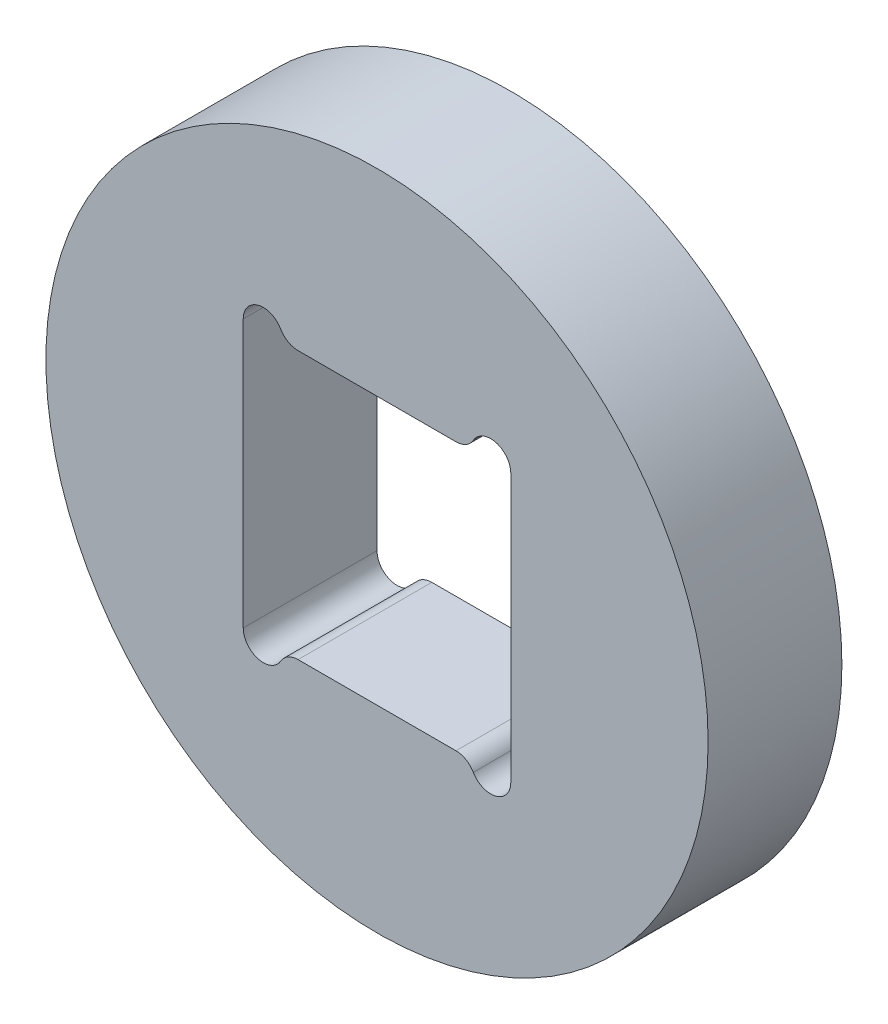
ISO-10303-21;
HEADER;
FILE_DESCRIPTION(('STEP AP214'),'2;1');
FILE_NAME('part.step','',(''),(''),'','','');
FILE_SCHEMA(('AUTOMOTIVE_DESIGN { 1 0 10303 214 1 1 1 1 }'));
ENDSEC;
DATA;
#1=APPLICATION_CONTEXT('core data for automotive mechanical design processes');
#2=APPLICATION_PROTOCOL_DEFINITION('international standard','automotive_design',2000,#1);
#3=PRODUCT_CONTEXT('',#1,'mechanical');
#4=PRODUCT('Part','Part','',(#3));
#5=PRODUCT_RELATED_PRODUCT_CATEGORY('part','',(#4));
#6=PRODUCT_DEFINITION_FORMATION('','',#4);
#7=PRODUCT_DEFINITION_CONTEXT('part definition',#1,'design');
#8=PRODUCT_DEFINITION('design','',#6,#7);
#9=PRODUCT_DEFINITION_SHAPE('','',#8);
#10=(LENGTH_UNIT() NAMED_UNIT(*) SI_UNIT(.MILLI.,.METRE.));
#11=(NAMED_UNIT(*) PLANE_ANGLE_UNIT() SI_UNIT($,.RADIAN.));
#12=(NAMED_UNIT(*) SI_UNIT($,.STERADIAN.) SOLID_ANGLE_UNIT());
#13=UNCERTAINTY_MEASURE_WITH_UNIT(LENGTH_MEASURE(1.E-05),#10,'distance_accuracy_value','');
#14=(GEOMETRIC_REPRESENTATION_CONTEXT(3) GLOBAL_UNCERTAINTY_ASSIGNED_CONTEXT((#13)) GLOBAL_UNIT_ASSIGNED_CONTEXT((#10,
#11,#12)) REPRESENTATION_CONTEXT('',''));
#15=CARTESIAN_POINT('',(0.,0.,0.));
#16=DIRECTION('',(0.,0.,1.));
#17=DIRECTION('',(1.,0.,0.));
#18=AXIS2_PLACEMENT_3D('',#15,#16,#17);
#19=CARTESIAN_POINT('',(0.,0.,10.));
#20=DIRECTION('',(0.,0.,1.));
#21=DIRECTION('',(1.,0.,0.));
#22=AXIS2_PLACEMENT_3D('',#19,#20,#21);
#23=PLANE('',#22);
#24=CARTESIAN_POINT('',(0.,0.,10.));
#25=DIRECTION('',(0.,0.,1.));
#26=DIRECTION('',(1.,0.,0.));
#27=AXIS2_PLACEMENT_3D('',#24,#25,#26);
#28=CIRCLE('',#27,24.75);
#29=CARTESIAN_POINT('',(24.75,0.,10.));
#30=VERTEX_POINT('',#29);
#31=EDGE_CURVE('E11',#30,#30,#28,.T.);
#32=ORIENTED_EDGE('',*,*,#31,.T.);
#33=EDGE_LOOP('',(#32));
#34=FACE_BOUND('',#33,.T.);
#35=DIRECTION('',(0.,-1.,0.));
#36=VECTOR('',#35,1.);
#37=CARTESIAN_POINT('',(-10.,-10.0000000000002,10.));
#38=LINE('',#37,#36);
#39=CARTESIAN_POINT('',(-10.,10.,10.));
#40=VERTEX_POINT('',#39);
#41=CARTESIAN_POINT('',(-10.,-10.0000000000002,10.));
#42=VERTEX_POINT('',#41);
#43=EDGE_CURVE('E144',#40,#42,#38,.T.);
#44=ORIENTED_EDGE('',*,*,#43,.F.);
#45=CARTESIAN_POINT('',(-8.5,10.,10.));
#46=DIRECTION('',(0.,0.,1.));
#47=DIRECTION('',(1.,0.,0.));
#48=AXIS2_PLACEMENT_3D('',#45,#46,#47);
#49=CIRCLE('',#48,1.5);
#50=CARTESIAN_POINT('',(-7.20096189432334,10.75,10.));
#51=VERTEX_POINT('',#50);
#52=EDGE_CURVE('E135',#51,#40,#49,.T.);
#53=ORIENTED_EDGE('',*,*,#52,.F.);
#54=CARTESIAN_POINT('',(-5.90192378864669,11.5,10.));
#55=DIRECTION('',(0.,0.,-1.));
#56=DIRECTION('',(1.,0.,0.));
#57=AXIS2_PLACEMENT_3D('',#54,#55,#56);
#58=CIRCLE('',#57,1.5);
#59=CARTESIAN_POINT('',(-5.90192378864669,10.,10.));
#60=VERTEX_POINT('',#59);
#61=EDGE_CURVE('E187',#60,#51,#58,.T.);
#62=ORIENTED_EDGE('',*,*,#61,.F.);
#63=DIRECTION('',(-1.,0.,0.));
#64=VECTOR('',#63,1.);
#65=CARTESIAN_POINT('',(-5.90192378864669,10.,10.));
#66=LINE('',#65,#64);
#67=CARTESIAN_POINT('',(5.90192378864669,10.,10.));
#68=VERTEX_POINT('',#67);
#69=EDGE_CURVE('E184',#68,#60,#66,.T.);
#70=ORIENTED_EDGE('',*,*,#69,.F.);
#71=CARTESIAN_POINT('',(5.90192378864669,11.5,10.));
#72=DIRECTION('',(0.,0.,-1.));
#73=DIRECTION('',(1.,0.,0.));
#74=AXIS2_PLACEMENT_3D('',#71,#72,#73);
#75=CIRCLE('',#74,1.5);
#76=CARTESIAN_POINT('',(7.20096189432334,10.75,10.));
#77=VERTEX_POINT('',#76);
#78=EDGE_CURVE('E181',#77,#68,#75,.T.);
#79=ORIENTED_EDGE('',*,*,#78,.F.);
#80=CARTESIAN_POINT('',(8.5,10.,10.));
#81=DIRECTION('',(0.,0.,1.));
#82=DIRECTION('',(1.,0.,0.));
#83=AXIS2_PLACEMENT_3D('',#80,#81,#82);
#84=CIRCLE('',#83,1.5);
#85=CARTESIAN_POINT('',(10.,10.,10.));
#86=VERTEX_POINT('',#85);
#87=EDGE_CURVE('E178',#86,#77,#84,.T.);
#88=ORIENTED_EDGE('',*,*,#87,.F.);
#89=DIRECTION('',(0.,1.,0.));
#90=VECTOR('',#89,1.);
#91=CARTESIAN_POINT('',(10.,10.,10.));
#92=LINE('',#91,#90);
#93=CARTESIAN_POINT('',(10.,-10.0000000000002,10.));
#94=VERTEX_POINT('',#93);
#95=EDGE_CURVE('E175',#94,#86,#92,.T.);
#96=ORIENTED_EDGE('',*,*,#95,.F.);
#97=CARTESIAN_POINT('',(8.5,-10.0000000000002,10.));
#98=DIRECTION('',(0.,0.,1.));
#99=DIRECTION('',(1.,0.,0.));
#100=AXIS2_PLACEMENT_3D('',#97,#98,#99);
#101=CIRCLE('',#100,1.5);
#102=CARTESIAN_POINT('',(7.20096189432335,-10.7500000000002,10.));
#103=VERTEX_POINT('',#102);
#104=EDGE_CURVE('E172',#103,#94,#101,.T.);
#105=ORIENTED_EDGE('',*,*,#104,.F.);
#106=CARTESIAN_POINT('',(5.90192378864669,-11.5000000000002,10.));
#107=DIRECTION('',(0.,0.,-1.));
#108=DIRECTION('',(1.,0.,0.));
#109=AXIS2_PLACEMENT_3D('',#106,#107,#108);
#110=CIRCLE('',#109,1.5);
#111=CARTESIAN_POINT('',(5.90192378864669,-10.0000000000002,10.));
#112=VERTEX_POINT('',#111);
#113=EDGE_CURVE('E169',#112,#103,#110,.T.);
#114=ORIENTED_EDGE('',*,*,#113,.F.);
#115=DIRECTION('',(1.,0.,0.));
#116=VECTOR('',#115,1.);
#117=CARTESIAN_POINT('',(5.90192378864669,-10.0000000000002,10.));
#118=LINE('',#117,#116);
#119=CARTESIAN_POINT('',(-5.90192378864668,-10.0000000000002,10.));
#120=VERTEX_POINT('',#119);
#121=EDGE_CURVE('E166',#120,#112,#118,.T.);
#122=ORIENTED_EDGE('',*,*,#121,.F.);
#123=CARTESIAN_POINT('',(-5.90192378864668,-11.5000000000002,10.));
#124=DIRECTION('',(0.,0.,-1.));
#125=DIRECTION('',(1.,0.,0.));
#126=AXIS2_PLACEMENT_3D('',#123,#124,#125);
#127=CIRCLE('',#126,1.5);
#128=CARTESIAN_POINT('',(-7.20096189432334,-10.7500000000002,10.));
#129=VERTEX_POINT('',#128);
#130=EDGE_CURVE('E161',#129,#120,#127,.T.);
#131=ORIENTED_EDGE('',*,*,#130,.F.);
#132=CARTESIAN_POINT('',(-8.5,-10.0000000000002,10.));
#133=DIRECTION('',(0.,0.,1.));
#134=DIRECTION('',(1.,0.,0.));
#135=AXIS2_PLACEMENT_3D('',#132,#133,#134);
#136=CIRCLE('',#135,1.5);
#137=EDGE_CURVE('E157',#42,#129,#136,.T.);
#138=ORIENTED_EDGE('',*,*,#137,.F.);
#139=EDGE_LOOP('',(#44,#53,#62,#70,#79,#88,#96,#105,#114,#122,#131,#138));
#140=FACE_BOUND('',#139,.T.);
#141=ADVANCED_FACE('F45',(#34,#140),#23,.T.);
#142=CARTESIAN_POINT('',(0.,0.,0.));
#143=DIRECTION('',(0.,0.,1.));
#144=DIRECTION('',(1.,0.,0.));
#145=AXIS2_PLACEMENT_3D('',#142,#143,#144);
#146=PLANE('',#145);
#147=CARTESIAN_POINT('',(0.,0.,0.));
#148=DIRECTION('',(0.,0.,1.));
#149=DIRECTION('',(1.,0.,0.));
#150=AXIS2_PLACEMENT_3D('',#147,#148,#149);
#151=CIRCLE('',#150,24.75);
#152=CARTESIAN_POINT('',(24.75,0.,0.));
#153=VERTEX_POINT('',#152);
#154=EDGE_CURVE('E49',#153,#153,#151,.T.);
#155=ORIENTED_EDGE('',*,*,#154,.F.);
#156=EDGE_LOOP('',(#155));
#157=FACE_BOUND('',#156,.T.);
#158=CARTESIAN_POINT('',(-8.5,10.,0.));
#159=DIRECTION('',(0.,0.,1.));
#160=DIRECTION('',(1.,0.,0.));
#161=AXIS2_PLACEMENT_3D('',#158,#159,#160);
#162=CIRCLE('',#161,1.5);
#163=CARTESIAN_POINT('',(-7.20096189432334,10.75,0.));
#164=VERTEX_POINT('',#163);
#165=CARTESIAN_POINT('',(-10.,10.,0.));
#166=VERTEX_POINT('',#165);
#167=EDGE_CURVE('E69',#164,#166,#162,.T.);
#168=ORIENTED_EDGE('',*,*,#167,.T.);
#169=DIRECTION('',(0.,-1.,0.));
#170=VECTOR('',#169,1.);
#171=CARTESIAN_POINT('',(-10.,-10.0000000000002,0.));
#172=LINE('',#171,#170);
#173=CARTESIAN_POINT('',(-10.,-10.0000000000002,0.));
#174=VERTEX_POINT('',#173);
#175=EDGE_CURVE('E151',#166,#174,#172,.T.);
#176=ORIENTED_EDGE('',*,*,#175,.T.);
#177=CARTESIAN_POINT('',(-8.5,-10.0000000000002,0.));
#178=DIRECTION('',(0.,0.,1.));
#179=DIRECTION('',(1.,0.,0.));
#180=AXIS2_PLACEMENT_3D('',#177,#178,#179);
#181=CIRCLE('',#180,1.5);
#182=CARTESIAN_POINT('',(-7.20096189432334,-10.7500000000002,0.));
#183=VERTEX_POINT('',#182);
#184=EDGE_CURVE('E194',#174,#183,#181,.T.);
#185=ORIENTED_EDGE('',*,*,#184,.T.);
#186=CARTESIAN_POINT('',(-5.90192378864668,-11.5000000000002,0.));
#187=DIRECTION('',(0.,0.,-1.));
#188=DIRECTION('',(1.,0.,0.));
#189=AXIS2_PLACEMENT_3D('',#186,#187,#188);
#190=CIRCLE('',#189,1.5);
#191=CARTESIAN_POINT('',(-5.90192378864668,-10.0000000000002,0.));
#192=VERTEX_POINT('',#191);
#193=EDGE_CURVE('E198',#183,#192,#190,.T.);
#194=ORIENTED_EDGE('',*,*,#193,.T.);
#195=DIRECTION('',(1.,0.,0.));
#196=VECTOR('',#195,1.);
#197=CARTESIAN_POINT('',(5.90192378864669,-10.0000000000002,0.));
#198=LINE('',#197,#196);
#199=CARTESIAN_POINT('',(5.90192378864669,-10.0000000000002,0.));
#200=VERTEX_POINT('',#199);
#201=EDGE_CURVE('E202',#192,#200,#198,.T.);
#202=ORIENTED_EDGE('',*,*,#201,.T.);
#203=CARTESIAN_POINT('',(5.90192378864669,-11.5000000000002,0.));
#204=DIRECTION('',(0.,0.,-1.));
#205=DIRECTION('',(1.,0.,0.));
#206=AXIS2_PLACEMENT_3D('',#203,#204,#205);
#207=CIRCLE('',#206,1.5);
#208=CARTESIAN_POINT('',(7.20096189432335,-10.7500000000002,0.));
#209=VERTEX_POINT('',#208);
#210=EDGE_CURVE('E206',#200,#209,#207,.T.);
#211=ORIENTED_EDGE('',*,*,#210,.T.);
#212=CARTESIAN_POINT('',(8.5,-10.0000000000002,0.));
#213=DIRECTION('',(0.,0.,1.));
#214=DIRECTION('',(1.,0.,0.));
#215=AXIS2_PLACEMENT_3D('',#212,#213,#214);
#216=CIRCLE('',#215,1.5);
#217=CARTESIAN_POINT('',(10.,-10.0000000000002,0.));
#218=VERTEX_POINT('',#217);
#219=EDGE_CURVE('E210',#209,#218,#216,.T.);
#220=ORIENTED_EDGE('',*,*,#219,.T.);
#221=DIRECTION('',(0.,1.,0.));
#222=VECTOR('',#221,1.);
#223=CARTESIAN_POINT('',(10.,10.,0.));
#224=LINE('',#223,#222);
#225=CARTESIAN_POINT('',(10.,10.,0.));
#226=VERTEX_POINT('',#225);
#227=EDGE_CURVE('E214',#218,#226,#224,.T.);
#228=ORIENTED_EDGE('',*,*,#227,.T.);
#229=CARTESIAN_POINT('',(8.5,10.,0.));
#230=DIRECTION('',(0.,0.,1.));
#231=DIRECTION('',(1.,0.,0.));
#232=AXIS2_PLACEMENT_3D('',#229,#230,#231);
#233=CIRCLE('',#232,1.5);
#234=CARTESIAN_POINT('',(7.20096189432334,10.75,0.));
#235=VERTEX_POINT('',#234);
#236=EDGE_CURVE('E218',#226,#235,#233,.T.);
#237=ORIENTED_EDGE('',*,*,#236,.T.);
#238=CARTESIAN_POINT('',(5.90192378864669,11.5,0.));
#239=DIRECTION('',(0.,0.,-1.));
#240=DIRECTION('',(1.,0.,0.));
#241=AXIS2_PLACEMENT_3D('',#238,#239,#240);
#242=CIRCLE('',#241,1.5);
#243=CARTESIAN_POINT('',(5.90192378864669,10.,0.));
#244=VERTEX_POINT('',#243);
#245=EDGE_CURVE('E222',#235,#244,#242,.T.);
#246=ORIENTED_EDGE('',*,*,#245,.T.);
#247=DIRECTION('',(-1.,0.,0.));
#248=VECTOR('',#247,1.);
#249=CARTESIAN_POINT('',(-5.90192378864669,10.,0.));
#250=LINE('',#249,#248);
#251=CARTESIAN_POINT('',(-5.90192378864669,10.,0.));
#252=VERTEX_POINT('',#251);
#253=EDGE_CURVE('E226',#244,#252,#250,.T.);
#254=ORIENTED_EDGE('',*,*,#253,.T.);
#255=CARTESIAN_POINT('',(-5.90192378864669,11.5,0.));
#256=DIRECTION('',(0.,0.,-1.));
#257=DIRECTION('',(1.,0.,0.));
#258=AXIS2_PLACEMENT_3D('',#255,#256,#257);
#259=CIRCLE('',#258,1.5);
#260=EDGE_CURVE('E145',#252,#164,#259,.T.);
#261=ORIENTED_EDGE('',*,*,#260,.T.);
#262=EDGE_LOOP('',(#168,#176,#185,#194,#202,#211,#220,#228,#237,#246,#254,#261));
#263=FACE_BOUND('',#262,.T.);
#264=ADVANCED_FACE('F268',(#157,#263),#146,.F.);
#265=CARTESIAN_POINT('',(0.,0.,10.));
#266=DIRECTION('',(0.,0.,-1.));
#267=DIRECTION('',(-1.,0.,0.));
#268=AXIS2_PLACEMENT_3D('',#265,#266,#267);
#269=CYLINDRICAL_SURFACE('',#268,24.75);
#270=ORIENTED_EDGE('',*,*,#31,.F.);
#271=EDGE_LOOP('',(#270));
#272=FACE_BOUND('',#271,.T.);
#273=ORIENTED_EDGE('',*,*,#154,.T.);
#274=EDGE_LOOP('',(#273));
#275=FACE_BOUND('',#274,.T.);
#276=ADVANCED_FACE('F47',(#272,#275),#269,.T.);
#277=CARTESIAN_POINT('',(-8.5,10.,10.));
#278=DIRECTION('',(0.,0.,-1.));
#279=DIRECTION('',(-1.,0.,0.));
#280=AXIS2_PLACEMENT_3D('',#277,#278,#279);
#281=CYLINDRICAL_SURFACE('',#280,1.5);
#282=ORIENTED_EDGE('',*,*,#167,.F.);
#283=DIRECTION('',(0.,0.,-1.));
#284=VECTOR('',#283,1.);
#285=CARTESIAN_POINT('',(-7.20096189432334,10.75,10.));
#286=LINE('',#285,#284);
#287=EDGE_CURVE('E139',#51,#164,#286,.T.);
#288=ORIENTED_EDGE('',*,*,#287,.F.);
#289=ORIENTED_EDGE('',*,*,#52,.T.);
#290=DIRECTION('',(0.,0.,-1.));
#291=VECTOR('',#290,1.);
#292=CARTESIAN_POINT('',(-10.,10.,10.));
#293=LINE('',#292,#291);
#294=EDGE_CURVE('E138',#40,#166,#293,.T.);
#295=ORIENTED_EDGE('',*,*,#294,.T.);
#296=EDGE_LOOP('',(#282,#288,#289,#295));
#297=FACE_BOUND('',#296,.T.);
#298=ADVANCED_FACE('F137',(#297),#281,.F.);
#299=CARTESIAN_POINT('',(-10.,-10.0000000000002,10.));
#300=DIRECTION('',(1.,0.,0.));
#301=DIRECTION('',(0.,1.,0.));
#302=AXIS2_PLACEMENT_3D('',#299,#300,#301);
#303=PLANE('',#302);
#304=ORIENTED_EDGE('',*,*,#175,.F.);
#305=ORIENTED_EDGE('',*,*,#294,.F.);
#306=ORIENTED_EDGE('',*,*,#43,.T.);
#307=DIRECTION('',(0.,0.,-1.));
#308=VECTOR('',#307,1.);
#309=CARTESIAN_POINT('',(-10.,-10.0000000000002,10.));
#310=LINE('',#309,#308);
#311=EDGE_CURVE('E153',#42,#174,#310,.T.);
#312=ORIENTED_EDGE('',*,*,#311,.T.);
#313=EDGE_LOOP('',(#304,#305,#306,#312));
#314=FACE_BOUND('',#313,.T.);
#315=ADVANCED_FACE('F148',(#314),#303,.T.);
#316=CARTESIAN_POINT('',(-8.5,-10.0000000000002,10.));
#317=DIRECTION('',(0.,0.,-1.));
#318=DIRECTION('',(-1.,0.,0.));
#319=AXIS2_PLACEMENT_3D('',#316,#317,#318);
#320=CYLINDRICAL_SURFACE('',#319,1.5);
#321=ORIENTED_EDGE('',*,*,#184,.F.);
#322=ORIENTED_EDGE('',*,*,#311,.F.);
#323=ORIENTED_EDGE('',*,*,#137,.T.);
#324=DIRECTION('',(0.,0.,-1.));
#325=VECTOR('',#324,1.);
#326=CARTESIAN_POINT('',(-7.20096189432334,-10.7500000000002,10.));
#327=LINE('',#326,#325);
#328=EDGE_CURVE('E258',#129,#183,#327,.T.);
#329=ORIENTED_EDGE('',*,*,#328,.T.);
#330=EDGE_LOOP('',(#321,#322,#323,#329));
#331=FACE_BOUND('',#330,.T.);
#332=ADVANCED_FACE('F264',(#331),#320,.F.);
#333=CARTESIAN_POINT('',(-5.90192378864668,-11.5000000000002,10.));
#334=DIRECTION('',(0.,0.,-1.));
#335=DIRECTION('',(-1.,0.,0.));
#336=AXIS2_PLACEMENT_3D('',#333,#334,#335);
#337=CYLINDRICAL_SURFACE('',#336,1.5);
#338=ORIENTED_EDGE('',*,*,#193,.F.);
#339=ORIENTED_EDGE('',*,*,#328,.F.);
#340=ORIENTED_EDGE('',*,*,#130,.T.);
#341=DIRECTION('',(0.,0.,-1.));
#342=VECTOR('',#341,1.);
#343=CARTESIAN_POINT('',(-5.90192378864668,-10.0000000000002,10.));
#344=LINE('',#343,#342);
#345=EDGE_CURVE('E255',#120,#192,#344,.T.);
#346=ORIENTED_EDGE('',*,*,#345,.T.);
#347=EDGE_LOOP('',(#338,#339,#340,#346));
#348=FACE_BOUND('',#347,.T.);
#349=ADVANCED_FACE('F306',(#348),#337,.T.);
#350=CARTESIAN_POINT('',(5.90192378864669,-10.0000000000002,10.));
#351=DIRECTION('',(0.,1.,0.));
#352=DIRECTION('',(-1.,0.,0.));
#353=AXIS2_PLACEMENT_3D('',#350,#351,#352);
#354=PLANE('',#353);
#355=ORIENTED_EDGE('',*,*,#201,.F.);
#356=ORIENTED_EDGE('',*,*,#345,.F.);
#357=ORIENTED_EDGE('',*,*,#121,.T.);
#358=DIRECTION('',(0.,0.,-1.));
#359=VECTOR('',#358,1.);
#360=CARTESIAN_POINT('',(5.90192378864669,-10.0000000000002,10.));
#361=LINE('',#360,#359);
#362=EDGE_CURVE('E252',#112,#200,#361,.T.);
#363=ORIENTED_EDGE('',*,*,#362,.T.);
#364=EDGE_LOOP('',(#355,#356,#357,#363));
#365=FACE_BOUND('',#364,.T.);
#366=ADVANCED_FACE('F304',(#365),#354,.T.);
#367=CARTESIAN_POINT('',(5.90192378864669,-11.5000000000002,10.));
#368=DIRECTION('',(0.,0.,-1.));
#369=DIRECTION('',(-1.,0.,0.));
#370=AXIS2_PLACEMENT_3D('',#367,#368,#369);
#371=CYLINDRICAL_SURFACE('',#370,1.5);
#372=ORIENTED_EDGE('',*,*,#210,.F.);
#373=ORIENTED_EDGE('',*,*,#362,.F.);
#374=ORIENTED_EDGE('',*,*,#113,.T.);
#375=DIRECTION('',(0.,0.,-1.));
#376=VECTOR('',#375,1.);
#377=CARTESIAN_POINT('',(7.20096189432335,-10.7500000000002,10.));
#378=LINE('',#377,#376);
#379=EDGE_CURVE('E249',#103,#209,#378,.T.);
#380=ORIENTED_EDGE('',*,*,#379,.T.);
#381=EDGE_LOOP('',(#372,#373,#374,#380));
#382=FACE_BOUND('',#381,.T.);
#383=ADVANCED_FACE('F298',(#382),#371,.T.);
#384=CARTESIAN_POINT('',(8.5,-10.0000000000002,10.));
#385=DIRECTION('',(0.,0.,-1.));
#386=DIRECTION('',(-1.,0.,0.));
#387=AXIS2_PLACEMENT_3D('',#384,#385,#386);
#388=CYLINDRICAL_SURFACE('',#387,1.5);
#389=ORIENTED_EDGE('',*,*,#219,.F.);
#390=ORIENTED_EDGE('',*,*,#379,.F.);
#391=ORIENTED_EDGE('',*,*,#104,.T.);
#392=DIRECTION('',(0.,0.,-1.));
#393=VECTOR('',#392,1.);
#394=CARTESIAN_POINT('',(10.,-10.0000000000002,10.));
#395=LINE('',#394,#393);
#396=EDGE_CURVE('E246',#94,#218,#395,.T.);
#397=ORIENTED_EDGE('',*,*,#396,.T.);
#398=EDGE_LOOP('',(#389,#390,#391,#397));
#399=FACE_BOUND('',#398,.T.);
#400=ADVANCED_FACE('F294',(#399),#388,.F.);
#401=CARTESIAN_POINT('',(10.,10.,10.));
#402=DIRECTION('',(-1.,0.,0.));
#403=DIRECTION('',(0.,-1.,0.));
#404=AXIS2_PLACEMENT_3D('',#401,#402,#403);
#405=PLANE('',#404);
#406=ORIENTED_EDGE('',*,*,#227,.F.);
#407=ORIENTED_EDGE('',*,*,#396,.F.);
#408=ORIENTED_EDGE('',*,*,#95,.T.);
#409=DIRECTION('',(0.,0.,-1.));
#410=VECTOR('',#409,1.);
#411=CARTESIAN_POINT('',(10.,10.,10.));
#412=LINE('',#411,#410);
#413=EDGE_CURVE('E243',#86,#226,#412,.T.);
#414=ORIENTED_EDGE('',*,*,#413,.T.);
#415=EDGE_LOOP('',(#406,#407,#408,#414));
#416=FACE_BOUND('',#415,.T.);
#417=ADVANCED_FACE('F291',(#416),#405,.T.);
#418=CARTESIAN_POINT('',(8.5,10.,10.));
#419=DIRECTION('',(0.,0.,-1.));
#420=DIRECTION('',(-1.,0.,0.));
#421=AXIS2_PLACEMENT_3D('',#418,#419,#420);
#422=CYLINDRICAL_SURFACE('',#421,1.5);
#423=ORIENTED_EDGE('',*,*,#236,.F.);
#424=ORIENTED_EDGE('',*,*,#413,.F.);
#425=ORIENTED_EDGE('',*,*,#87,.T.);
#426=DIRECTION('',(0.,0.,-1.));
#427=VECTOR('',#426,1.);
#428=CARTESIAN_POINT('',(7.20096189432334,10.75,10.));
#429=LINE('',#428,#427);
#430=EDGE_CURVE('E240',#77,#235,#429,.T.);
#431=ORIENTED_EDGE('',*,*,#430,.T.);
#432=EDGE_LOOP('',(#423,#424,#425,#431));
#433=FACE_BOUND('',#432,.T.);
#434=ADVANCED_FACE('F283',(#433),#422,.F.);
#435=CARTESIAN_POINT('',(5.90192378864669,11.5,10.));
#436=DIRECTION('',(0.,0.,-1.));
#437=DIRECTION('',(-1.,0.,0.));
#438=AXIS2_PLACEMENT_3D('',#435,#436,#437);
#439=CYLINDRICAL_SURFACE('',#438,1.5);
#440=ORIENTED_EDGE('',*,*,#245,.F.);
#441=ORIENTED_EDGE('',*,*,#430,.F.);
#442=ORIENTED_EDGE('',*,*,#78,.T.);
#443=DIRECTION('',(0.,0.,-1.));
#444=VECTOR('',#443,1.);
#445=CARTESIAN_POINT('',(5.90192378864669,10.,10.));
#446=LINE('',#445,#444);
#447=EDGE_CURVE('E237',#68,#244,#446,.T.);
#448=ORIENTED_EDGE('',*,*,#447,.T.);
#449=EDGE_LOOP('',(#440,#441,#442,#448));
#450=FACE_BOUND('',#449,.T.);
#451=ADVANCED_FACE('F279',(#450),#439,.T.);
#452=CARTESIAN_POINT('',(-5.90192378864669,10.,10.));
#453=DIRECTION('',(0.,-1.,0.));
#454=DIRECTION('',(0.,0.,-1.));
#455=AXIS2_PLACEMENT_3D('',#452,#453,#454);
#456=PLANE('',#455);
#457=ORIENTED_EDGE('',*,*,#253,.F.);
#458=ORIENTED_EDGE('',*,*,#447,.F.);
#459=ORIENTED_EDGE('',*,*,#69,.T.);
#460=DIRECTION('',(0.,0.,-1.));
#461=VECTOR('',#460,1.);
#462=CARTESIAN_POINT('',(-5.90192378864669,10.,10.));
#463=LINE('',#462,#461);
#464=EDGE_CURVE('E61',#60,#252,#463,.T.);
#465=ORIENTED_EDGE('',*,*,#464,.T.);
#466=EDGE_LOOP('',(#457,#458,#459,#465));
#467=FACE_BOUND('',#466,.T.);
#468=ADVANCED_FACE('F276',(#467),#456,.T.);
#469=CARTESIAN_POINT('',(-5.90192378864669,11.5,10.));
#470=DIRECTION('',(0.,0.,-1.));
#471=DIRECTION('',(-1.,0.,0.));
#472=AXIS2_PLACEMENT_3D('',#469,#470,#471);
#473=CYLINDRICAL_SURFACE('',#472,1.5);
#474=ORIENTED_EDGE('',*,*,#260,.F.);
#475=ORIENTED_EDGE('',*,*,#464,.F.);
#476=ORIENTED_EDGE('',*,*,#61,.T.);
#477=ORIENTED_EDGE('',*,*,#287,.T.);
#478=EDGE_LOOP('',(#474,#475,#476,#477));
#479=FACE_BOUND('',#478,.T.);
#480=ADVANCED_FACE('F270',(#479),#473,.T.);
#481=CLOSED_SHELL('',(#141,#264,#276,#298,#315,#332,#349,#366,#383,#400,#417,#434,#451,#468,#480));
#482=MANIFOLD_SOLID_BREP('B2',#481);
#483=ADVANCED_BREP_SHAPE_REPRESENTATION('',(#18,#482),#14);
#484=SHAPE_DEFINITION_REPRESENTATION(#9,#483);
ENDSEC;
END-ISO-10303-21;
